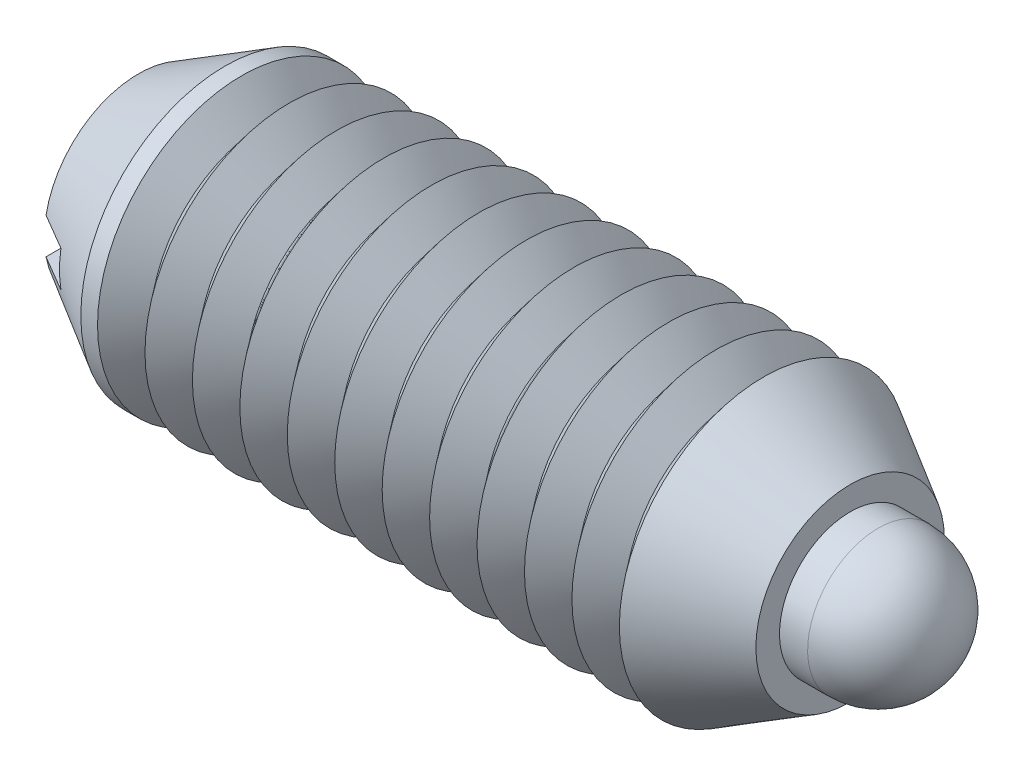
ISO-10303-21;
HEADER;
FILE_DESCRIPTION(('STEP AP214'),'2;1');
FILE_NAME('part.step','',(''),(''),'','','');
FILE_SCHEMA(('AUTOMOTIVE_DESIGN { 1 0 10303 214 1 1 1 1 }'));
ENDSEC;
DATA;
#1=APPLICATION_CONTEXT('core data for automotive mechanical design processes');
#2=APPLICATION_PROTOCOL_DEFINITION('international standard','automotive_design',2000,#1);
#3=PRODUCT_CONTEXT('',#1,'mechanical');
#4=PRODUCT('Part','Part','',(#3));
#5=PRODUCT_RELATED_PRODUCT_CATEGORY('part','',(#4));
#6=PRODUCT_DEFINITION_FORMATION('','',#4);
#7=PRODUCT_DEFINITION_CONTEXT('part definition',#1,'design');
#8=PRODUCT_DEFINITION('design','',#6,#7);
#9=PRODUCT_DEFINITION_SHAPE('','',#8);
#10=(LENGTH_UNIT() NAMED_UNIT(*) SI_UNIT(.MILLI.,.METRE.));
#11=(NAMED_UNIT(*) PLANE_ANGLE_UNIT() SI_UNIT($,.RADIAN.));
#12=(NAMED_UNIT(*) SI_UNIT($,.STERADIAN.) SOLID_ANGLE_UNIT());
#13=UNCERTAINTY_MEASURE_WITH_UNIT(LENGTH_MEASURE(1.E-05),#10,'distance_accuracy_value','');
#14=(GEOMETRIC_REPRESENTATION_CONTEXT(3) GLOBAL_UNCERTAINTY_ASSIGNED_CONTEXT((#13)) GLOBAL_UNIT_ASSIGNED_CONTEXT((#10,
#11,#12)) REPRESENTATION_CONTEXT('',''));
#15=CARTESIAN_POINT('',(0.,0.,0.));
#16=DIRECTION('',(0.,0.,1.));
#17=DIRECTION('',(1.,0.,0.));
#18=AXIS2_PLACEMENT_3D('',#15,#16,#17);
#19=CARTESIAN_POINT('',(9.18972,0.,0.));
#20=DIRECTION('',(-1.,0.,0.));
#21=DIRECTION('',(0.,-0.719424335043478,-0.694570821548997));
#22=AXIS2_PLACEMENT_3D('',#19,#20,#21);
#23=PLANE('',#22);
#24=CARTESIAN_POINT('',(9.18972,0.,0.));
#25=DIRECTION('',(1.,0.,0.));
#26=DIRECTION('',(0.,0.719424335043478,0.694570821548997));
#27=AXIS2_PLACEMENT_3D('',#24,#25,#26);
#28=CIRCLE('',#27,1.1811);
#29=CARTESIAN_POINT('',(9.18972,0.849712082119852,0.82035759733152));
#30=VERTEX_POINT('',#29);
#31=EDGE_CURVE('P0_E10',#30,#30,#28,.T.);
#32=ORIENTED_EDGE('',*,*,#31,.F.);
#33=EDGE_LOOP('',(#32));
#34=FACE_BOUND('',#33,.T.);
#35=ADVANCED_FACE('P0_F14',(#34),#23,.T.);
#36=CARTESIAN_POINT('',(9.42594,0.,0.));
#37=DIRECTION('',(1.,0.,0.));
#38=DIRECTION('',(0.,0.719424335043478,0.694570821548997));
#39=AXIS2_PLACEMENT_3D('',#36,#37,#38);
#40=CONICAL_SURFACE('',#39,1.41732,0.785398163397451);
#41=ORIENTED_EDGE('',*,*,#31,.T.);
#42=EDGE_LOOP('',(#41));
#43=FACE_BOUND('',#42,.T.);
#44=CARTESIAN_POINT('',(9.42594,0.,0.));
#45=DIRECTION('',(1.,0.,0.));
#46=DIRECTION('',(0.,0.719424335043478,0.694570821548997));
#47=AXIS2_PLACEMENT_3D('',#44,#45,#46);
#48=CIRCLE('',#47,1.41732);
#49=CARTESIAN_POINT('',(9.42594,1.01965449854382,0.984429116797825));
#50=VERTEX_POINT('',#49);
#51=EDGE_CURVE('P0_E20',#50,#50,#48,.T.);
#52=ORIENTED_EDGE('',*,*,#51,.F.);
#53=EDGE_LOOP('',(#52));
#54=FACE_BOUND('',#53,.T.);
#55=ADVANCED_FACE('P0_F54',(#43,#54),#40,.T.);
#56=CARTESIAN_POINT('',(13.55725,0.,0.));
#57=DIRECTION('',(1.,0.,0.));
#58=DIRECTION('',(0.,0.719424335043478,0.694570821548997));
#59=AXIS2_PLACEMENT_3D('',#56,#57,#58);
#60=CYLINDRICAL_SURFACE('',#59,1.41732);
#61=ORIENTED_EDGE('',*,*,#51,.T.);
#62=EDGE_LOOP('',(#61));
#63=FACE_BOUND('',#62,.T.);
#64=CARTESIAN_POINT('',(11.1427749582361,0.,0.));
#65=DIRECTION('',(1.,0.,0.));
#66=DIRECTION('',(0.,0.719424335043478,0.694570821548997));
#67=AXIS2_PLACEMENT_3D('',#64,#65,#66);
#68=CIRCLE('',#67,1.41732);
#69=CARTESIAN_POINT('',(11.1427749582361,1.01965449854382,0.984429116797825));
#70=VERTEX_POINT('',#69);
#71=EDGE_CURVE('P0_E24',#70,#70,#68,.T.);
#72=ORIENTED_EDGE('',*,*,#71,.F.);
#73=EDGE_LOOP('',(#72));
#74=FACE_BOUND('',#73,.T.);
#75=ADVANCED_FACE('P0_F50',(#63,#74),#60,.T.);
#76=CARTESIAN_POINT('',(11.55192,0.,0.));
#77=DIRECTION('',(-1.,0.,0.));
#78=DIRECTION('',(0.,-0.719424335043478,-0.694570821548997));
#79=AXIS2_PLACEMENT_3D('',#76,#77,#78);
#80=CONICAL_SURFACE('',#79,1.1811,0.523598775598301);
#81=ORIENTED_EDGE('',*,*,#71,.T.);
#82=EDGE_LOOP('',(#81));
#83=FACE_BOUND('',#82,.T.);
#84=CARTESIAN_POINT('',(11.55192,0.,0.));
#85=DIRECTION('',(1.,0.,0.));
#86=DIRECTION('',(0.,0.719424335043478,0.694570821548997));
#87=AXIS2_PLACEMENT_3D('',#84,#85,#86);
#88=CIRCLE('',#87,1.1811);
#89=CARTESIAN_POINT('',(11.55192,0.849712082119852,0.820357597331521));
#90=VERTEX_POINT('',#89);
#91=EDGE_CURVE('P0_E28',#90,#90,#88,.T.);
#92=ORIENTED_EDGE('',*,*,#91,.F.);
#93=EDGE_LOOP('',(#92));
#94=FACE_BOUND('',#93,.T.);
#95=ADVANCED_FACE('P0_F41',(#83,#94),#80,.T.);
#96=CARTESIAN_POINT('',(13.55725,0.,0.));
#97=DIRECTION('',(1.,0.,0.));
#98=DIRECTION('',(0.,0.719424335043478,0.694570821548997));
#99=AXIS2_PLACEMENT_3D('',#96,#97,#98);
#100=CYLINDRICAL_SURFACE('',#99,1.1811);
#101=ORIENTED_EDGE('',*,*,#91,.T.);
#102=EDGE_LOOP('',(#101));
#103=FACE_BOUND('',#102,.T.);
#104=CARTESIAN_POINT('',(12.37615,0.,0.));
#105=DIRECTION('',(1.,0.,0.));
#106=DIRECTION('',(0.,0.719424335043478,0.694570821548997));
#107=AXIS2_PLACEMENT_3D('',#104,#105,#106);
#108=CIRCLE('',#107,1.1811);
#109=CARTESIAN_POINT('',(12.37615,0.849712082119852,0.820357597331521));
#110=VERTEX_POINT('',#109);
#111=EDGE_CURVE('P0_E33',#110,#110,#108,.T.);
#112=ORIENTED_EDGE('',*,*,#111,.F.);
#113=EDGE_LOOP('',(#112));
#114=FACE_BOUND('',#113,.T.);
#115=ADVANCED_FACE('P0_F39',(#103,#114),#100,.T.);
#116=CARTESIAN_POINT('',(12.37615,0.,0.));
#117=DIRECTION('',(1.,0.,0.));
#118=DIRECTION('',(0.,-0.719424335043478,-0.694570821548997));
#119=AXIS2_PLACEMENT_3D('',#116,#117,#118);
#120=SPHERICAL_SURFACE('',#119,1.1811);
#121=ORIENTED_EDGE('',*,*,#111,.T.);
#122=EDGE_LOOP('',(#121));
#123=FACE_BOUND('',#122,.T.);
#124=ADVANCED_FACE('P0_F37',(#123),#120,.T.);
#125=CLOSED_SHELL('',(#35,#55,#75,#95,#115,#124));
#126=MANIFOLD_SOLID_BREP('P0_B1',#125);
#127=CARTESIAN_POINT('',(3.96875,4.826,-2.413));
#128=DIRECTION('',(-1.,0.,0.));
#129=DIRECTION('',(0.,-1.,0.));
#130=AXIS2_PLACEMENT_3D('',#127,#128,#129);
#131=PLANE('',#130);
#132=CARTESIAN_POINT('',(3.96875,0.,0.));
#133=DIRECTION('',(-1.,0.,0.));
#134=DIRECTION('',(0.,-1.,0.));
#135=AXIS2_PLACEMENT_3D('',#132,#133,#134);
#136=CIRCLE('',#135,2.23851475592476);
#137=CARTESIAN_POINT('',(3.96875,-2.23851475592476,0.));
#138=VERTEX_POINT('',#137);
#139=EDGE_CURVE('P1_E31',#138,#138,#136,.F.);
#140=ORIENTED_EDGE('',*,*,#139,.F.);
#141=EDGE_LOOP('',(#140));
#142=FACE_BOUND('',#141,.T.);
#143=CARTESIAN_POINT('',(3.96875,0.,0.));
#144=DIRECTION('',(1.,0.,0.));
#145=DIRECTION('',(0.,0.,-1.));
#146=AXIS2_PLACEMENT_3D('',#143,#144,#145);
#147=CIRCLE('',#146,1.44272);
#148=CARTESIAN_POINT('',(3.96875,0.,-1.44272));
#149=VERTEX_POINT('',#148);
#150=EDGE_CURVE('P1_E47',#149,#149,#147,.T.);
#151=ORIENTED_EDGE('',*,*,#150,.T.);
#152=EDGE_LOOP('',(#151));
#153=FACE_BOUND('',#152,.T.);
#154=ADVANCED_FACE('P1_F14',(#142,#153),#131,.T.);
#155=CARTESIAN_POINT('',(7.9375,4.826,-2.413));
#156=DIRECTION('',(1.,0.,0.));
#157=DIRECTION('',(0.,0.,-1.));
#158=AXIS2_PLACEMENT_3D('',#155,#156,#157);
#159=PLANE('',#158);
#160=CARTESIAN_POINT('',(7.9375,0.,0.));
#161=DIRECTION('',(1.,0.,0.));
#162=DIRECTION('',(0.,0.,-1.));
#163=AXIS2_PLACEMENT_3D('',#160,#161,#162);
#164=CIRCLE('',#163,2.23851475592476);
#165=CARTESIAN_POINT('',(7.9375,0.,-2.23851475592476));
#166=VERTEX_POINT('',#165);
#167=EDGE_CURVE('P1_E33',#166,#166,#164,.F.);
#168=ORIENTED_EDGE('',*,*,#167,.F.);
#169=EDGE_LOOP('',(#168));
#170=FACE_BOUND('',#169,.T.);
#171=CARTESIAN_POINT('',(7.9375,0.,0.));
#172=DIRECTION('',(1.,0.,0.));
#173=DIRECTION('',(0.,0.,-1.));
#174=AXIS2_PLACEMENT_3D('',#171,#172,#173);
#175=CIRCLE('',#174,1.44272);
#176=CARTESIAN_POINT('',(7.9375,0.,-1.44272));
#177=VERTEX_POINT('',#176);
#178=EDGE_CURVE('P1_E18',#177,#177,#175,.F.);
#179=ORIENTED_EDGE('',*,*,#178,.T.);
#180=EDGE_LOOP('',(#179));
#181=FACE_BOUND('',#180,.T.);
#182=ADVANCED_FACE('P1_F80',(#170,#181),#159,.T.);
#183=CARTESIAN_POINT('',(6.09282499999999,0.,0.));
#184=DIRECTION('',(1.,0.,0.));
#185=DIRECTION('',(0.,0.,-1.));
#186=AXIS2_PLACEMENT_3D('',#183,#184,#185);
#187=CONICAL_SURFACE('',#186,1.91730328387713,0.895664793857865);
#188=CARTESIAN_POINT('',(6.48969999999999,0.,0.));
#189=DIRECTION('',(-1.,0.,0.));
#190=DIRECTION('',(0.,0.,1.));
#191=AXIS2_PLACEMENT_3D('',#188,#189,#190);
#192=CIRCLE('',#191,2.413);
#193=CARTESIAN_POINT('',(6.48969999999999,0.,2.413));
#194=VERTEX_POINT('',#193);
#195=EDGE_CURVE('P1_E57',#194,#194,#192,.T.);
#196=ORIENTED_EDGE('',*,*,#195,.T.);
#197=EDGE_LOOP('',(#196));
#198=FACE_BOUND('',#197,.T.);
#199=CARTESIAN_POINT('',(6.09282499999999,0.,0.));
#200=DIRECTION('',(-1.,0.,0.));
#201=DIRECTION('',(0.,0.,1.));
#202=AXIS2_PLACEMENT_3D('',#199,#200,#201);
#203=CIRCLE('',#202,1.91730328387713);
#204=CARTESIAN_POINT('',(6.09282499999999,0.,1.91730328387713));
#205=VERTEX_POINT('',#204);
#206=EDGE_CURVE('P1_E60',#205,#205,#203,.T.);
#207=ORIENTED_EDGE('',*,*,#206,.F.);
#208=EDGE_LOOP('',(#207));
#209=FACE_BOUND('',#208,.T.);
#210=ADVANCED_FACE('P1_F86',(#198,#209),#187,.T.);
#211=CARTESIAN_POINT('',(6.48969999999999,0.,0.));
#212=DIRECTION('',(-1.,0.,0.));
#213=DIRECTION('',(0.,0.,1.));
#214=AXIS2_PLACEMENT_3D('',#211,#212,#213);
#215=CONICAL_SURFACE('',#214,2.413,0.895664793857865);
#216=CARTESIAN_POINT('',(6.88657499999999,0.,0.));
#217=DIRECTION('',(-1.,0.,0.));
#218=DIRECTION('',(0.,0.,1.));
#219=AXIS2_PLACEMENT_3D('',#216,#217,#218);
#220=CIRCLE('',#219,1.91730328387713);
#221=CARTESIAN_POINT('',(6.88657499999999,0.,1.91730328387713));
#222=VERTEX_POINT('',#221);
#223=EDGE_CURVE('P1_E22',#222,#222,#220,.T.);
#224=ORIENTED_EDGE('',*,*,#223,.T.);
#225=EDGE_LOOP('',(#224));
#226=FACE_BOUND('',#225,.T.);
#227=ORIENTED_EDGE('',*,*,#195,.F.);
#228=EDGE_LOOP('',(#227));
#229=FACE_BOUND('',#228,.T.);
#230=ADVANCED_FACE('P1_F77',(#226,#229),#215,.T.);
#231=CARTESIAN_POINT('',(6.88657499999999,0.,0.));
#232=DIRECTION('',(1.,0.,0.));
#233=DIRECTION('',(0.,0.,-1.));
#234=AXIS2_PLACEMENT_3D('',#231,#232,#233);
#235=CONICAL_SURFACE('',#234,1.91730328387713,0.895664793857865);
#236=CARTESIAN_POINT('',(7.28344999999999,0.,0.));
#237=DIRECTION('',(-1.,0.,0.));
#238=DIRECTION('',(0.,0.,1.));
#239=AXIS2_PLACEMENT_3D('',#236,#237,#238);
#240=CIRCLE('',#239,2.413);
#241=CARTESIAN_POINT('',(7.28344999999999,0.,2.413));
#242=VERTEX_POINT('',#241);
#243=EDGE_CURVE('P1_E27',#242,#242,#240,.T.);
#244=ORIENTED_EDGE('',*,*,#243,.T.);
#245=EDGE_LOOP('',(#244));
#246=FACE_BOUND('',#245,.T.);
#247=ORIENTED_EDGE('',*,*,#223,.F.);
#248=EDGE_LOOP('',(#247));
#249=FACE_BOUND('',#248,.T.);
#250=ADVANCED_FACE('P1_F65',(#246,#249),#235,.T.);
#251=CARTESIAN_POINT('',(7.28344999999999,0.,0.));
#252=DIRECTION('',(-1.,0.,0.));
#253=DIRECTION('',(0.,0.,1.));
#254=AXIS2_PLACEMENT_3D('',#251,#252,#253);
#255=CONICAL_SURFACE('',#254,2.413,0.895664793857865);
#256=CARTESIAN_POINT('',(7.68032499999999,0.,0.));
#257=DIRECTION('',(-1.,0.,0.));
#258=DIRECTION('',(0.,0.,1.));
#259=AXIS2_PLACEMENT_3D('',#256,#257,#258);
#260=CIRCLE('',#259,1.91730328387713);
#261=CARTESIAN_POINT('',(7.68032499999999,0.,1.91730328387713));
#262=VERTEX_POINT('',#261);
#263=EDGE_CURVE('P1_E10',#262,#262,#260,.T.);
#264=ORIENTED_EDGE('',*,*,#263,.T.);
#265=EDGE_LOOP('',(#264));
#266=FACE_BOUND('',#265,.T.);
#267=ORIENTED_EDGE('',*,*,#243,.F.);
#268=EDGE_LOOP('',(#267));
#269=FACE_BOUND('',#268,.T.);
#270=ADVANCED_FACE('P1_F68',(#266,#269),#255,.T.);
#271=CARTESIAN_POINT('',(7.68032499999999,0.,0.));
#272=DIRECTION('',(1.,0.,0.));
#273=DIRECTION('',(0.,0.,-1.));
#274=AXIS2_PLACEMENT_3D('',#271,#272,#273);
#275=CONICAL_SURFACE('',#274,1.91730328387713,0.895664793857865);
#276=ORIENTED_EDGE('',*,*,#263,.F.);
#277=EDGE_LOOP('',(#276));
#278=FACE_BOUND('',#277,.T.);
#279=ORIENTED_EDGE('',*,*,#167,.T.);
#280=EDGE_LOOP('',(#279));
#281=FACE_BOUND('',#280,.T.);
#282=ADVANCED_FACE('P1_F16',(#278,#281),#275,.T.);
#283=CARTESIAN_POINT('',(5.69594999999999,0.,0.));
#284=DIRECTION('',(-1.,0.,0.));
#285=DIRECTION('',(0.,0.,1.));
#286=AXIS2_PLACEMENT_3D('',#283,#284,#285);
#287=CONICAL_SURFACE('',#286,2.413,0.895664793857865);
#288=ORIENTED_EDGE('',*,*,#206,.T.);
#289=EDGE_LOOP('',(#288));
#290=FACE_BOUND('',#289,.T.);
#291=CARTESIAN_POINT('',(5.69594999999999,0.,0.));
#292=DIRECTION('',(-1.,0.,0.));
#293=DIRECTION('',(0.,0.,1.));
#294=AXIS2_PLACEMENT_3D('',#291,#292,#293);
#295=CIRCLE('',#294,2.413);
#296=CARTESIAN_POINT('',(5.69594999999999,0.,2.413));
#297=VERTEX_POINT('',#296);
#298=EDGE_CURVE('P1_E51',#297,#297,#295,.T.);
#299=ORIENTED_EDGE('',*,*,#298,.F.);
#300=EDGE_LOOP('',(#299));
#301=FACE_BOUND('',#300,.T.);
#302=ADVANCED_FACE('P1_F75',(#290,#301),#287,.T.);
#303=CARTESIAN_POINT('',(5.29907499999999,0.,0.));
#304=DIRECTION('',(1.,0.,0.));
#305=DIRECTION('',(0.,0.,-1.));
#306=AXIS2_PLACEMENT_3D('',#303,#304,#305);
#307=CONICAL_SURFACE('',#306,1.91730328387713,0.895664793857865);
#308=ORIENTED_EDGE('',*,*,#298,.T.);
#309=EDGE_LOOP('',(#308));
#310=FACE_BOUND('',#309,.T.);
#311=CARTESIAN_POINT('',(5.29907499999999,0.,0.));
#312=DIRECTION('',(-1.,0.,0.));
#313=DIRECTION('',(0.,0.,1.));
#314=AXIS2_PLACEMENT_3D('',#311,#312,#313);
#315=CIRCLE('',#314,1.91730328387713);
#316=CARTESIAN_POINT('',(5.29907499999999,0.,1.91730328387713));
#317=VERTEX_POINT('',#316);
#318=EDGE_CURVE('P1_E54',#317,#317,#315,.T.);
#319=ORIENTED_EDGE('',*,*,#318,.F.);
#320=EDGE_LOOP('',(#319));
#321=FACE_BOUND('',#320,.T.);
#322=ADVANCED_FACE('P1_F108',(#310,#321),#307,.T.);
#323=CARTESIAN_POINT('',(4.90219999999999,0.,0.));
#324=DIRECTION('',(-1.,0.,0.));
#325=DIRECTION('',(0.,0.,1.));
#326=AXIS2_PLACEMENT_3D('',#323,#324,#325);
#327=CONICAL_SURFACE('',#326,2.413,0.895664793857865);
#328=ORIENTED_EDGE('',*,*,#318,.T.);
#329=EDGE_LOOP('',(#328));
#330=FACE_BOUND('',#329,.T.);
#331=CARTESIAN_POINT('',(4.90219999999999,0.,0.));
#332=DIRECTION('',(-1.,0.,0.));
#333=DIRECTION('',(0.,0.,1.));
#334=AXIS2_PLACEMENT_3D('',#331,#332,#333);
#335=CIRCLE('',#334,2.413);
#336=CARTESIAN_POINT('',(4.90219999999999,0.,2.413));
#337=VERTEX_POINT('',#336);
#338=EDGE_CURVE('P1_E39',#337,#337,#335,.T.);
#339=ORIENTED_EDGE('',*,*,#338,.F.);
#340=EDGE_LOOP('',(#339));
#341=FACE_BOUND('',#340,.T.);
#342=ADVANCED_FACE('P1_F104',(#330,#341),#327,.T.);
#343=CARTESIAN_POINT('',(4.50532499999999,0.,0.));
#344=DIRECTION('',(1.,0.,0.));
#345=DIRECTION('',(0.,0.,-1.));
#346=AXIS2_PLACEMENT_3D('',#343,#344,#345);
#347=CONICAL_SURFACE('',#346,1.91730328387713,0.895664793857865);
#348=ORIENTED_EDGE('',*,*,#338,.T.);
#349=EDGE_LOOP('',(#348));
#350=FACE_BOUND('',#349,.T.);
#351=CARTESIAN_POINT('',(4.50532499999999,0.,0.));
#352=DIRECTION('',(-1.,0.,0.));
#353=DIRECTION('',(0.,0.,1.));
#354=AXIS2_PLACEMENT_3D('',#351,#352,#353);
#355=CIRCLE('',#354,1.91730328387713);
#356=CARTESIAN_POINT('',(4.50532499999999,0.,1.91730328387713));
#357=VERTEX_POINT('',#356);
#358=EDGE_CURVE('P1_E44',#357,#357,#355,.T.);
#359=ORIENTED_EDGE('',*,*,#358,.F.);
#360=EDGE_LOOP('',(#359));
#361=FACE_BOUND('',#360,.T.);
#362=ADVANCED_FACE('P1_F100',(#350,#361),#347,.T.);
#363=CARTESIAN_POINT('',(4.10844999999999,0.,0.));
#364=DIRECTION('',(-1.,0.,0.));
#365=DIRECTION('',(0.,0.,1.));
#366=AXIS2_PLACEMENT_3D('',#363,#364,#365);
#367=CONICAL_SURFACE('',#366,2.413,0.895664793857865);
#368=ORIENTED_EDGE('',*,*,#358,.T.);
#369=EDGE_LOOP('',(#368));
#370=FACE_BOUND('',#369,.T.);
#371=CARTESIAN_POINT('',(4.10844999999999,0.,0.));
#372=DIRECTION('',(-1.,0.,0.));
#373=DIRECTION('',(0.,0.,1.));
#374=AXIS2_PLACEMENT_3D('',#371,#372,#373);
#375=CIRCLE('',#374,2.413);
#376=CARTESIAN_POINT('',(4.10844999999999,0.,2.413));
#377=VERTEX_POINT('',#376);
#378=EDGE_CURVE('P1_E35',#377,#377,#375,.T.);
#379=ORIENTED_EDGE('',*,*,#378,.F.);
#380=EDGE_LOOP('',(#379));
#381=FACE_BOUND('',#380,.T.);
#382=ADVANCED_FACE('P1_F97',(#370,#381),#367,.T.);
#383=CARTESIAN_POINT('',(3.71157499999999,0.,0.));
#384=DIRECTION('',(1.,0.,0.));
#385=DIRECTION('',(0.,0.,-1.));
#386=AXIS2_PLACEMENT_3D('',#383,#384,#385);
#387=CONICAL_SURFACE('',#386,1.91730328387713,0.895664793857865);
#388=ORIENTED_EDGE('',*,*,#378,.T.);
#389=EDGE_LOOP('',(#388));
#390=FACE_BOUND('',#389,.T.);
#391=ORIENTED_EDGE('',*,*,#139,.T.);
#392=EDGE_LOOP('',(#391));
#393=FACE_BOUND('',#392,.T.);
#394=ADVANCED_FACE('P1_F93',(#390,#393),#387,.T.);
#395=CARTESIAN_POINT('',(11.90625,0.,0.));
#396=DIRECTION('',(-1.,0.,0.));
#397=DIRECTION('',(0.,0.,1.));
#398=AXIS2_PLACEMENT_3D('',#395,#396,#397);
#399=CYLINDRICAL_SURFACE('',#398,1.44272);
#400=ORIENTED_EDGE('',*,*,#178,.F.);
#401=EDGE_LOOP('',(#400));
#402=FACE_BOUND('',#401,.T.);
#403=ORIENTED_EDGE('',*,*,#150,.F.);
#404=EDGE_LOOP('',(#403));
#405=FACE_BOUND('',#404,.T.);
#406=ADVANCED_FACE('P1_F96',(#402,#405),#399,.F.);
#407=CLOSED_SHELL('',(#154,#182,#210,#230,#250,#270,#282,#302,#322,#342,#362,#382,#394,#406));
#408=MANIFOLD_SOLID_BREP('P1_B1',#407);
#409=CARTESIAN_POINT('',(11.90625,0.,0.));
#410=DIRECTION('',(1.,0.,0.));
#411=DIRECTION('',(0.,0.,-1.));
#412=AXIS2_PLACEMENT_3D('',#409,#410,#411);
#413=PLANE('',#412);
#414=CARTESIAN_POINT('',(11.90625,0.,0.));
#415=DIRECTION('',(1.,0.,0.));
#416=DIRECTION('',(0.,0.,-1.));
#417=AXIS2_PLACEMENT_3D('',#414,#415,#416);
#418=CIRCLE('',#417,1.57711228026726);
#419=CARTESIAN_POINT('',(11.90625,0.,-1.57711228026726));
#420=VERTEX_POINT('',#419);
#421=EDGE_CURVE('P2_E79',#420,#420,#418,.T.);
#422=ORIENTED_EDGE('',*,*,#421,.T.);
#423=EDGE_LOOP('',(#422));
#424=FACE_BOUND('',#423,.T.);
#425=CARTESIAN_POINT('',(11.90625,0.,0.));
#426=DIRECTION('',(-1.,0.,0.));
#427=DIRECTION('',(0.,0.,1.));
#428=AXIS2_PLACEMENT_3D('',#425,#426,#427);
#429=CIRCLE('',#428,1.1811);
#430=CARTESIAN_POINT('',(11.90625,0.,1.1811));
#431=VERTEX_POINT('',#430);
#432=EDGE_CURVE('P2_E66',#431,#431,#429,.T.);
#433=ORIENTED_EDGE('',*,*,#432,.T.);
#434=EDGE_LOOP('',(#433));
#435=FACE_BOUND('',#434,.T.);
#436=ADVANCED_FACE('P2_F15',(#424,#435),#413,.T.);
#437=CARTESIAN_POINT('',(11.90625,0.,0.));
#438=DIRECTION('',(-1.,0.,0.));
#439=DIRECTION('',(0.,0.,1.));
#440=AXIS2_PLACEMENT_3D('',#437,#438,#439);
#441=CONICAL_SURFACE('',#440,1.57711228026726,0.523598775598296);
#442=CARTESIAN_POINT('',(10.45845,0.,0.));
#443=DIRECTION('',(-1.,0.,0.));
#444=DIRECTION('',(0.,0.,1.));
#445=AXIS2_PLACEMENT_3D('',#442,#443,#444);
#446=CIRCLE('',#445,2.413);
#447=CARTESIAN_POINT('',(10.45845,0.,2.413));
#448=VERTEX_POINT('',#447);
#449=EDGE_CURVE('P2_E157',#448,#448,#446,.T.);
#450=ORIENTED_EDGE('',*,*,#449,.F.);
#451=EDGE_LOOP('',(#450));
#452=FACE_BOUND('',#451,.T.);
#453=ORIENTED_EDGE('',*,*,#421,.F.);
#454=EDGE_LOOP('',(#453));
#455=FACE_BOUND('',#454,.T.);
#456=ADVANCED_FACE('P2_F17',(#452,#455),#441,.T.);
#457=CARTESIAN_POINT('',(0.,0.,0.));
#458=DIRECTION('',(-1.,0.,0.));
#459=DIRECTION('',(0.,0.,1.));
#460=AXIS2_PLACEMENT_3D('',#457,#458,#459);
#461=CYLINDRICAL_SURFACE('',#460,1.1811);
#462=CARTESIAN_POINT('',(11.55192,0.,0.));
#463=DIRECTION('',(-1.,0.,0.));
#464=DIRECTION('',(0.,0.,1.));
#465=AXIS2_PLACEMENT_3D('',#462,#463,#464);
#466=CIRCLE('',#465,1.1811);
#467=CARTESIAN_POINT('',(11.55192,0.,1.1811));
#468=VERTEX_POINT('',#467);
#469=EDGE_CURVE('P2_E169',#468,#468,#466,.T.);
#470=ORIENTED_EDGE('',*,*,#469,.T.);
#471=EDGE_LOOP('',(#470));
#472=FACE_BOUND('',#471,.T.);
#473=ORIENTED_EDGE('',*,*,#432,.F.);
#474=EDGE_LOOP('',(#473));
#475=FACE_BOUND('',#474,.T.);
#476=ADVANCED_FACE('P2_F195',(#472,#475),#461,.F.);
#477=CARTESIAN_POINT('',(11.55192,0.,0.));
#478=DIRECTION('',(-1.,0.,0.));
#479=DIRECTION('',(0.,0.,1.));
#480=AXIS2_PLACEMENT_3D('',#477,#478,#479);
#481=CONICAL_SURFACE('',#480,1.1811,0.785398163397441);
#482=CARTESIAN_POINT('',(11.3157,0.,0.));
#483=DIRECTION('',(-1.,0.,0.));
#484=DIRECTION('',(0.,0.,1.));
#485=AXIS2_PLACEMENT_3D('',#482,#483,#484);
#486=CIRCLE('',#485,1.41732);
#487=CARTESIAN_POINT('',(11.3157,0.,1.41732));
#488=VERTEX_POINT('',#487);
#489=EDGE_CURVE('P2_E166',#488,#488,#486,.T.);
#490=ORIENTED_EDGE('',*,*,#489,.T.);
#491=EDGE_LOOP('',(#490));
#492=FACE_BOUND('',#491,.T.);
#493=ORIENTED_EDGE('',*,*,#469,.F.);
#494=EDGE_LOOP('',(#493));
#495=FACE_BOUND('',#494,.T.);
#496=ADVANCED_FACE('P2_F202',(#492,#495),#481,.F.);
#497=CARTESIAN_POINT('',(0.,0.,0.));
#498=DIRECTION('',(-1.,0.,0.));
#499=DIRECTION('',(0.,0.,1.));
#500=AXIS2_PLACEMENT_3D('',#497,#498,#499);
#501=CYLINDRICAL_SURFACE('',#500,1.41732);
#502=CARTESIAN_POINT('',(1.80975,0.,0.));
#503=DIRECTION('',(-1.,0.,0.));
#504=DIRECTION('',(0.,0.,1.));
#505=AXIS2_PLACEMENT_3D('',#502,#503,#504);
#506=CIRCLE('',#505,1.41732);
#507=CARTESIAN_POINT('',(1.80975,0.,1.41732));
#508=VERTEX_POINT('',#507);
#509=EDGE_CURVE('P2_E163',#508,#508,#506,.T.);
#510=ORIENTED_EDGE('',*,*,#509,.T.);
#511=EDGE_LOOP('',(#510));
#512=FACE_BOUND('',#511,.T.);
#513=ORIENTED_EDGE('',*,*,#489,.F.);
#514=EDGE_LOOP('',(#513));
#515=FACE_BOUND('',#514,.T.);
#516=ADVANCED_FACE('P2_F207',(#512,#515),#501,.F.);
#517=CARTESIAN_POINT('',(1.80975,0.,0.));
#518=DIRECTION('',(1.,0.,0.));
#519=DIRECTION('',(0.,0.,-1.));
#520=AXIS2_PLACEMENT_3D('',#517,#518,#519);
#521=PLANE('',#520);
#522=ORIENTED_EDGE('',*,*,#509,.F.);
#523=EDGE_LOOP('',(#522));
#524=FACE_BOUND('',#523,.T.);
#525=ADVANCED_FACE('P2_F213',(#524),#521,.T.);
#526=CARTESIAN_POINT('',(10.061575,0.,0.));
#527=DIRECTION('',(1.,0.,0.));
#528=DIRECTION('',(0.,0.,-1.));
#529=AXIS2_PLACEMENT_3D('',#526,#527,#528);
#530=CONICAL_SURFACE('',#529,1.91730328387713,0.895664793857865);
#531=ORIENTED_EDGE('',*,*,#449,.T.);
#532=EDGE_LOOP('',(#531));
#533=FACE_BOUND('',#532,.T.);
#534=CARTESIAN_POINT('',(10.061575,0.,0.));
#535=DIRECTION('',(-1.,0.,0.));
#536=DIRECTION('',(0.,0.,1.));
#537=AXIS2_PLACEMENT_3D('',#534,#535,#536);
#538=CIRCLE('',#537,1.91730328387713);
#539=CARTESIAN_POINT('',(10.061575,0.,1.91730328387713));
#540=VERTEX_POINT('',#539);
#541=EDGE_CURVE('P2_E160',#540,#540,#538,.T.);
#542=ORIENTED_EDGE('',*,*,#541,.F.);
#543=EDGE_LOOP('',(#542));
#544=FACE_BOUND('',#543,.T.);
#545=ADVANCED_FACE('P2_F217',(#533,#544),#530,.T.);
#546=CARTESIAN_POINT('',(9.66469999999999,0.,0.));
#547=DIRECTION('',(-1.,0.,0.));
#548=DIRECTION('',(0.,0.,1.));
#549=AXIS2_PLACEMENT_3D('',#546,#547,#548);
#550=CONICAL_SURFACE('',#549,2.413,0.895664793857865);
#551=ORIENTED_EDGE('',*,*,#541,.T.);
#552=EDGE_LOOP('',(#551));
#553=FACE_BOUND('',#552,.T.);
#554=CARTESIAN_POINT('',(9.66469999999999,0.,0.));
#555=DIRECTION('',(-1.,0.,0.));
#556=DIRECTION('',(0.,0.,1.));
#557=AXIS2_PLACEMENT_3D('',#554,#555,#556);
#558=CIRCLE('',#557,2.413);
#559=CARTESIAN_POINT('',(9.66469999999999,0.,2.413));
#560=VERTEX_POINT('',#559);
#561=EDGE_CURVE('P2_E151',#560,#560,#558,.T.);
#562=ORIENTED_EDGE('',*,*,#561,.F.);
#563=EDGE_LOOP('',(#562));
#564=FACE_BOUND('',#563,.T.);
#565=ADVANCED_FACE('P2_F221',(#553,#564),#550,.T.);
#566=CARTESIAN_POINT('',(9.26782499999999,0.,0.));
#567=DIRECTION('',(1.,0.,0.));
#568=DIRECTION('',(0.,0.,-1.));
#569=AXIS2_PLACEMENT_3D('',#566,#567,#568);
#570=CONICAL_SURFACE('',#569,1.91730328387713,0.895664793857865);
#571=ORIENTED_EDGE('',*,*,#561,.T.);
#572=EDGE_LOOP('',(#571));
#573=FACE_BOUND('',#572,.T.);
#574=CARTESIAN_POINT('',(9.26782499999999,0.,0.));
#575=DIRECTION('',(-1.,0.,0.));
#576=DIRECTION('',(0.,0.,1.));
#577=AXIS2_PLACEMENT_3D('',#574,#575,#576);
#578=CIRCLE('',#577,1.91730328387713);
#579=CARTESIAN_POINT('',(9.26782499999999,0.,1.91730328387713));
#580=VERTEX_POINT('',#579);
#581=EDGE_CURVE('P2_E154',#580,#580,#578,.T.);
#582=ORIENTED_EDGE('',*,*,#581,.F.);
#583=EDGE_LOOP('',(#582));
#584=FACE_BOUND('',#583,.T.);
#585=ADVANCED_FACE('P2_F225',(#573,#584),#570,.T.);
#586=CARTESIAN_POINT('',(8.87094999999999,0.,0.));
#587=DIRECTION('',(-1.,0.,0.));
#588=DIRECTION('',(0.,0.,1.));
#589=AXIS2_PLACEMENT_3D('',#586,#587,#588);
#590=CONICAL_SURFACE('',#589,2.413,0.895664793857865);
#591=ORIENTED_EDGE('',*,*,#581,.T.);
#592=EDGE_LOOP('',(#591));
#593=FACE_BOUND('',#592,.T.);
#594=CARTESIAN_POINT('',(8.87094999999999,0.,0.));
#595=DIRECTION('',(-1.,0.,0.));
#596=DIRECTION('',(0.,0.,1.));
#597=AXIS2_PLACEMENT_3D('',#594,#595,#596);
#598=CIRCLE('',#597,2.413);
#599=CARTESIAN_POINT('',(8.87094999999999,0.,2.413));
#600=VERTEX_POINT('',#599);
#601=EDGE_CURVE('P2_E145',#600,#600,#598,.T.);
#602=ORIENTED_EDGE('',*,*,#601,.F.);
#603=EDGE_LOOP('',(#602));
#604=FACE_BOUND('',#603,.T.);
#605=ADVANCED_FACE('P2_F229',(#593,#604),#590,.T.);
#606=CARTESIAN_POINT('',(8.47407499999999,0.,0.));
#607=DIRECTION('',(1.,0.,0.));
#608=DIRECTION('',(0.,0.,-1.));
#609=AXIS2_PLACEMENT_3D('',#606,#607,#608);
#610=CONICAL_SURFACE('',#609,1.91730328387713,0.895664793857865);
#611=ORIENTED_EDGE('',*,*,#601,.T.);
#612=EDGE_LOOP('',(#611));
#613=FACE_BOUND('',#612,.T.);
#614=CARTESIAN_POINT('',(8.47407499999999,0.,0.));
#615=DIRECTION('',(-1.,0.,0.));
#616=DIRECTION('',(0.,0.,1.));
#617=AXIS2_PLACEMENT_3D('',#614,#615,#616);
#618=CIRCLE('',#617,1.91730328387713);
#619=CARTESIAN_POINT('',(8.47407499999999,0.,1.91730328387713));
#620=VERTEX_POINT('',#619);
#621=EDGE_CURVE('P2_E148',#620,#620,#618,.T.);
#622=ORIENTED_EDGE('',*,*,#621,.F.);
#623=EDGE_LOOP('',(#622));
#624=FACE_BOUND('',#623,.T.);
#625=ADVANCED_FACE('P2_F233',(#613,#624),#610,.T.);
#626=CARTESIAN_POINT('',(8.07719999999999,0.,0.));
#627=DIRECTION('',(-1.,0.,0.));
#628=DIRECTION('',(0.,0.,1.));
#629=AXIS2_PLACEMENT_3D('',#626,#627,#628);
#630=CONICAL_SURFACE('',#629,2.413,0.895664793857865);
#631=ORIENTED_EDGE('',*,*,#621,.T.);
#632=EDGE_LOOP('',(#631));
#633=FACE_BOUND('',#632,.T.);
#634=CARTESIAN_POINT('',(8.07719999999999,0.,0.));
#635=DIRECTION('',(-1.,0.,0.));
#636=DIRECTION('',(0.,0.,1.));
#637=AXIS2_PLACEMENT_3D('',#634,#635,#636);
#638=CIRCLE('',#637,2.413);
#639=CARTESIAN_POINT('',(8.07719999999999,0.,2.413));
#640=VERTEX_POINT('',#639);
#641=EDGE_CURVE('P2_E142',#640,#640,#638,.T.);
#642=ORIENTED_EDGE('',*,*,#641,.F.);
#643=EDGE_LOOP('',(#642));
#644=FACE_BOUND('',#643,.T.);
#645=ADVANCED_FACE('P2_F237',(#633,#644),#630,.T.);
#646=CARTESIAN_POINT('',(7.68032499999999,0.,0.));
#647=DIRECTION('',(1.,0.,0.));
#648=DIRECTION('',(0.,0.,-1.));
#649=AXIS2_PLACEMENT_3D('',#646,#647,#648);
#650=CONICAL_SURFACE('',#649,1.91730328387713,0.895664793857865);
#651=CARTESIAN_POINT('',(7.9375,0.,0.));
#652=DIRECTION('',(1.,0.,0.));
#653=DIRECTION('',(0.,0.,-1.));
#654=AXIS2_PLACEMENT_3D('',#651,#652,#653);
#655=CIRCLE('',#654,2.23851475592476);
#656=CARTESIAN_POINT('',(7.9375,0.,-2.23851475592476));
#657=VERTEX_POINT('',#656);
#658=EDGE_CURVE('P2_E19',#657,#657,#655,.F.);
#659=ORIENTED_EDGE('',*,*,#658,.F.);
#660=EDGE_LOOP('',(#659));
#661=FACE_BOUND('',#660,.T.);
#662=ORIENTED_EDGE('',*,*,#641,.T.);
#663=EDGE_LOOP('',(#662));
#664=FACE_BOUND('',#663,.T.);
#665=ADVANCED_FACE('P2_F241',(#661,#664),#650,.T.);
#666=CARTESIAN_POINT('',(3.96875,0.,0.));
#667=DIRECTION('',(1.,0.,0.));
#668=DIRECTION('',(0.,0.,-1.));
#669=AXIS2_PLACEMENT_3D('',#666,#667,#668);
#670=PLANE('',#669);
#671=CARTESIAN_POINT('',(3.96875,0.,0.));
#672=DIRECTION('',(1.,0.,0.));
#673=DIRECTION('',(0.,0.,-1.));
#674=AXIS2_PLACEMENT_3D('',#671,#672,#673);
#675=CIRCLE('',#674,2.23851475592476);
#676=CARTESIAN_POINT('',(3.96875,0.,-2.23851475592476));
#677=VERTEX_POINT('',#676);
#678=EDGE_CURVE('P2_E110',#677,#677,#675,.F.);
#679=ORIENTED_EDGE('',*,*,#678,.F.);
#680=EDGE_LOOP('',(#679));
#681=FACE_BOUND('',#680,.T.);
#682=CARTESIAN_POINT('',(3.96875,0.,0.));
#683=DIRECTION('',(1.,0.,0.));
#684=DIRECTION('',(0.,0.,-1.));
#685=AXIS2_PLACEMENT_3D('',#682,#683,#684);
#686=CIRCLE('',#685,1.44272);
#687=CARTESIAN_POINT('',(3.96875,0.,-1.44272));
#688=VERTEX_POINT('',#687);
#689=EDGE_CURVE('P2_E112',#688,#688,#686,.T.);
#690=ORIENTED_EDGE('',*,*,#689,.F.);
#691=EDGE_LOOP('',(#690));
#692=FACE_BOUND('',#691,.T.);
#693=ADVANCED_FACE('P2_F245',(#681,#692),#670,.T.);
#694=CARTESIAN_POINT('',(14.9039160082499,0.,0.));
#695=DIRECTION('',(-1.,0.,0.));
#696=DIRECTION('',(0.,0.,1.));
#697=AXIS2_PLACEMENT_3D('',#694,#695,#696);
#698=CYLINDRICAL_SURFACE('',#697,1.44272);
#699=ORIENTED_EDGE('',*,*,#689,.T.);
#700=EDGE_LOOP('',(#699));
#701=FACE_BOUND('',#700,.T.);
#702=CARTESIAN_POINT('',(7.9375,0.,0.));
#703=DIRECTION('',(1.,0.,0.));
#704=DIRECTION('',(0.,0.,-1.));
#705=AXIS2_PLACEMENT_3D('',#702,#703,#704);
#706=CIRCLE('',#705,1.44272);
#707=CARTESIAN_POINT('',(7.9375,0.,-1.44272));
#708=VERTEX_POINT('',#707);
#709=EDGE_CURVE('P2_E118',#708,#708,#706,.T.);
#710=ORIENTED_EDGE('',*,*,#709,.F.);
#711=EDGE_LOOP('',(#710));
#712=FACE_BOUND('',#711,.T.);
#713=ADVANCED_FACE('P2_F186',(#701,#712),#698,.T.);
#714=CARTESIAN_POINT('',(7.9375,0.,0.));
#715=DIRECTION('',(1.,0.,0.));
#716=DIRECTION('',(0.,0.,-1.));
#717=AXIS2_PLACEMENT_3D('',#714,#715,#716);
#718=PLANE('',#717);
#719=ORIENTED_EDGE('',*,*,#658,.T.);
#720=EDGE_LOOP('',(#719));
#721=FACE_BOUND('',#720,.T.);
#722=ORIENTED_EDGE('',*,*,#709,.T.);
#723=EDGE_LOOP('',(#722));
#724=FACE_BOUND('',#723,.T.);
#725=ADVANCED_FACE('P2_F181',(#721,#724),#718,.F.);
#726=CARTESIAN_POINT('',(0.,0.,0.));
#727=DIRECTION('',(1.,0.,0.));
#728=DIRECTION('',(0.,0.,-1.));
#729=AXIS2_PLACEMENT_3D('',#726,#727,#728);
#730=PLANE('',#729);
#731=CARTESIAN_POINT('',(0.,0.,0.));
#732=DIRECTION('',(1.,0.,0.));
#733=DIRECTION('',(0.,0.,-1.));
#734=AXIS2_PLACEMENT_3D('',#731,#732,#733);
#735=CIRCLE('',#734,1.57711228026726);
#736=CARTESIAN_POINT('',(0.,-0.301625,-1.54800048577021));
#737=VERTEX_POINT('',#736);
#738=CARTESIAN_POINT('',(0.,-0.301625,1.54800048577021));
#739=VERTEX_POINT('',#738);
#740=EDGE_CURVE('P2_E75',#737,#739,#735,.F.);
#741=ORIENTED_EDGE('',*,*,#740,.T.);
#742=DIRECTION('',(0.,0.,1.));
#743=VECTOR('',#742,1.);
#744=CARTESIAN_POINT('',(0.,-0.301625,-2.413));
#745=LINE('',#744,#743);
#746=EDGE_CURVE('P2_E33',#737,#739,#745,.T.);
#747=ORIENTED_EDGE('',*,*,#746,.F.);
#748=EDGE_LOOP('',(#741,#747));
#749=FACE_BOUND('',#748,.T.);
#750=ADVANCED_FACE('P2_F101',(#749),#730,.F.);
#751=CARTESIAN_POINT('',(0.,-0.301625,-2.413));
#752=DIRECTION('',(0.,-1.,0.));
#753=DIRECTION('',(0.,0.,-1.));
#754=AXIS2_PLACEMENT_3D('',#751,#752,#753);
#755=PLANE('',#754);
#756=CARTESIAN_POINT('',(3.52158419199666,-0.301625,-3.59767806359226));
#757=CARTESIAN_POINT('',(3.34576119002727,-0.301625,-3.49580919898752));
#758=CARTESIAN_POINT('',(3.1699501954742,-0.301625,-3.3939195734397));
#759=CARTESIAN_POINT('',(2.8183625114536,-0.301625,-3.19008072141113));
#760=CARTESIAN_POINT('',(2.64258582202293,-0.301625,-3.08813149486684));
#761=CARTESIAN_POINT('',(2.11525421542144,-0.301625,-2.78212758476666));
#762=CARTESIAN_POINT('',(1.7637667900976,-0.301625,-2.57795664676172));
#763=CARTESIAN_POINT('',(1.07028339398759,-0.301625,-2.17437275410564));
#764=CARTESIAN_POINT('',(0.728278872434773,-0.301625,-1.97497452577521));
#765=CARTESIAN_POINT('',(0.215888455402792,-0.301625,-1.674891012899));
#766=CARTESIAN_POINT('',(0.0452088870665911,-0.301625,-1.57470738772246));
#767=CARTESIAN_POINT('',(-0.295805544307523,-0.301625,-1.37375586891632));
#768=CARTESIAN_POINT('',(-0.466140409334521,-0.301625,-1.27298797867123));
#769=CARTESIAN_POINT('',(-0.72159216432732,-0.301625,-1.12068789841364));
#770=CARTESIAN_POINT('',(-0.806966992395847,-0.301625,-1.06958894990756));
#771=CARTESIAN_POINT('',(-0.977473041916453,-0.301625,-0.966920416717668));
#772=CARTESIAN_POINT('',(-1.06260417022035,-0.301625,-0.915350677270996));
#773=CARTESIAN_POINT('',(-1.23331135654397,-0.301625,-0.8109603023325));
#774=CARTESIAN_POINT('',(-1.31888290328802,-0.301625,-0.758132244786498));
#775=CARTESIAN_POINT('',(-1.44658022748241,-0.301625,-0.677929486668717));
#776=CARTESIAN_POINT('',(-1.48901559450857,-0.301625,-0.651048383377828));
#777=CARTESIAN_POINT('',(-1.5735852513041,-0.301625,-0.596818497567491));
#778=CARTESIAN_POINT('',(-1.61571955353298,-0.301625,-0.569469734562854));
#779=CARTESIAN_POINT('',(-1.69957056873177,-0.301625,-0.514061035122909));
#780=CARTESIAN_POINT('',(-1.7412868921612,-0.301625,-0.486000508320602));
#781=CARTESIAN_POINT('',(-1.82410813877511,-0.301625,-0.428735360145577));
#782=CARTESIAN_POINT('',(-1.86521107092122,-0.301625,-0.399527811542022));
#783=CARTESIAN_POINT('',(-1.92563905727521,-0.301625,-0.354477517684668));
#784=CARTESIAN_POINT('',(-1.9454820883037,-0.301625,-0.339332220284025));
#785=CARTESIAN_POINT('',(-1.98467245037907,-0.301625,-0.308416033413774));
#786=CARTESIAN_POINT('',(-2.00401989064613,-0.301625,-0.292645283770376));
#787=CARTESIAN_POINT('',(-2.04188576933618,-0.301625,-0.26028942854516));
#788=CARTESIAN_POINT('',(-2.06040735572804,-0.301625,-0.24370803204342));
#789=CARTESIAN_POINT('',(-2.09622171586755,-0.301625,-0.209281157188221));
#790=CARTESIAN_POINT('',(-2.11351640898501,-0.301625,-0.191437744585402));
#791=CARTESIAN_POINT('',(-2.14133100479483,-0.301625,-0.159102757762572));
#792=CARTESIAN_POINT('',(-2.15238809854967,-0.301625,-0.145080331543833));
#793=CARTESIAN_POINT('',(-2.17256921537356,-0.301625,-0.115713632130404));
#794=CARTESIAN_POINT('',(-2.18170056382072,-0.301625,-0.100374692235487));
#795=CARTESIAN_POINT('',(-2.19382853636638,-0.301625,-0.0743381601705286));
#796=CARTESIAN_POINT('',(-2.19783432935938,-0.301625,-0.0641208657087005));
#797=CARTESIAN_POINT('',(-2.20418408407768,-0.301625,-0.0431770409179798));
#798=CARTESIAN_POINT('',(-2.20653026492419,-0.301625,-0.0324512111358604));
#799=CARTESIAN_POINT('',(-2.2092242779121,-0.301625,-0.010645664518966));
#800=CARTESIAN_POINT('',(-2.20955478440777,-0.301625,0.000436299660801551));
#801=CARTESIAN_POINT('',(-2.20811049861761,-0.301625,0.0224590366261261));
#802=CARTESIAN_POINT('',(-2.20633477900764,-0.301625,0.0333997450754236));
#803=CARTESIAN_POINT('',(-2.20040920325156,-0.301625,0.0570547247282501));
#804=CARTESIAN_POINT('',(-2.19583992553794,-0.301625,0.0696604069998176));
#805=CARTESIAN_POINT('',(-2.18480257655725,-0.301625,0.0940122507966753));
#806=CARTESIAN_POINT('',(-2.17832876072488,-0.301625,0.105755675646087));
#807=CARTESIAN_POINT('',(-2.16201399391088,-0.301625,0.131787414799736));
#808=CARTESIAN_POINT('',(-2.15174355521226,-0.301625,0.145800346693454));
#809=CARTESIAN_POINT('',(-2.12990859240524,-0.301625,0.172793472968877));
#810=CARTESIAN_POINT('',(-2.11834123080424,-0.301625,0.185771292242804));
#811=CARTESIAN_POINT('',(-2.09430575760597,-0.301625,0.211025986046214));
#812=CARTESIAN_POINT('',(-2.08183197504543,-0.301625,0.223297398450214));
#813=CARTESIAN_POINT('',(-2.05633968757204,-0.301625,0.247224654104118));
#814=CARTESIAN_POINT('',(-2.04332180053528,-0.301625,0.258881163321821));
#815=CARTESIAN_POINT('',(-2.00078487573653,-0.301625,0.295691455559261));
#816=CARTESIAN_POINT('',(-1.97050807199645,-0.301625,0.319964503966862));
#817=CARTESIAN_POINT('',(-1.90896442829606,-0.301625,0.367229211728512));
#818=CARTESIAN_POINT('',(-1.87769694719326,-0.301625,0.390220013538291));
#819=CARTESIAN_POINT('',(-1.81450564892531,-0.301625,0.435405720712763));
#820=CARTESIAN_POINT('',(-1.78258072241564,-0.301625,0.457599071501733));
#821=CARTESIAN_POINT('',(-1.71833934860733,-0.301625,0.501413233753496));
#822=CARTESIAN_POINT('',(-1.68602286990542,-0.301625,0.523033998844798));
#823=CARTESIAN_POINT('',(-1.58882405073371,-0.301625,0.587196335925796));
#824=CARTESIAN_POINT('',(-1.52354718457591,-0.301625,0.629138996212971));
#825=CARTESIAN_POINT('',(-1.3925089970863,-0.301625,0.712079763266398));
#826=CARTESIAN_POINT('',(-1.32674833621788,-0.301625,0.753078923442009));
#827=CARTESIAN_POINT('',(-1.12973592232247,-0.301625,0.874776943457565));
#828=CARTESIAN_POINT('',(-0.997986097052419,-0.301625,0.954668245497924));
#829=CARTESIAN_POINT('',(-0.733894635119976,-0.301625,1.11347004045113));
#830=CARTESIAN_POINT('',(-0.601552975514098,-0.301625,1.19238049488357));
#831=CARTESIAN_POINT('',(-0.336468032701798,-0.301625,1.3496798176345));
#832=CARTESIAN_POINT('',(-0.203724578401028,-0.301625,1.42806839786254));
#833=CARTESIAN_POINT('',(0.061960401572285,-0.301625,1.58450354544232));
#834=CARTESIAN_POINT('',(0.194901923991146,-0.301625,1.662550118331));
#835=CARTESIAN_POINT('',(0.593753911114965,-0.301625,1.89626549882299));
#836=CARTESIAN_POINT('',(0.859856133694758,-0.301625,2.05160699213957));
#837=CARTESIAN_POINT('',(1.39226692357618,-0.301625,2.36184477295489));
#838=CARTESIAN_POINT('',(1.65857545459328,-0.301625,2.51674112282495));
#839=CARTESIAN_POINT('',(2.05793511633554,-0.301625,2.74877580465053));
#840=CARTESIAN_POINT('',(2.19093190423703,-0.301625,2.82600765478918));
#841=CARTESIAN_POINT('',(2.4569588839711,-0.301625,2.98042516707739));
#842=CARTESIAN_POINT('',(2.58998907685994,-0.301625,3.05761082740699));
#843=CARTESIAN_POINT('',(2.85610549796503,-0.301625,3.21196281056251));
#844=CARTESIAN_POINT('',(2.98919173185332,-0.301625,3.28912912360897));
#845=CARTESIAN_POINT('',(3.25537765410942,-0.301625,3.44342710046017));
#846=CARTESIAN_POINT('',(3.38847734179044,-0.301625,3.52055876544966));
#847=CARTESIAN_POINT('',(3.52158419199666,-0.301625,3.59767806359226));
#848=B_SPLINE_CURVE_WITH_KNOTS('',3,(#756,#757,#758,#759,#760,#761,#762,#763,#764,#765,#766,
#767,#768,#769,#770,#771,#772,#773,#774,#775,#776,#777,#778,#779,#780,#781,#782,#783,#784,#785,
#786,#787,#788,#789,#790,#791,#792,#793,#794,#795,#796,#797,#798,#799,#800,#801,#802,#803,#804,
#805,#806,#807,#808,#809,#810,#811,#812,#813,#814,#815,#816,#817,#818,#819,#820,#821,#822,#823,
#824,#825,#826,#827,#828,#829,#830,#831,#832,#833,#834,#835,#836,#837,#838,#839,#840,#841,#842,
#843,#844,#845,#846,#847),.UNSPECIFIED.,.F.,.F.,(4,2,2,2,2,2,2,2,2,2,2,2,2,2,2,2,2,2,2,2,2,2,2,
2,2,2,2,2,2,2,2,2,2,2,2,2,2,2,2,2,2,2,2,2,2,4),(0.,0.609605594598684,1.21921184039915,
2.43866364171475,3.62632366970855,4.22005256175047,4.81377801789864,5.11227266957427,
5.4108692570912,5.71255560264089,5.86325276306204,6.01394365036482,6.16476390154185,
6.31599786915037,6.39087726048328,6.46574000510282,6.54028748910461,6.61471565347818,
6.66820632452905,6.72148969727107,6.75430660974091,6.78707955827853,6.82013381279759,
6.85320262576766,6.89319888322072,6.93331703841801,6.98530796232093,7.03741494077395,
7.08988191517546,7.14229084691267,7.25863117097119,7.37504839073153,7.49168144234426,
7.60832391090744,7.84107846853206,8.07355913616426,8.535785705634,8.99803035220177,
9.46051193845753,9.92298600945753,10.8473616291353,11.771600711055,12.2329857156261,
12.6943878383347,13.1559062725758,13.6174074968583),.UNSPECIFIED.);
#849=CARTESIAN_POINT('',(0.60325,-0.301625,-1.90162641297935));
#850=VERTEX_POINT('',#849);
#851=EDGE_CURVE('P2_E92',#850,#737,#848,.T.);
#852=ORIENTED_EDGE('',*,*,#851,.T.);
#853=ORIENTED_EDGE('',*,*,#746,.T.);
#854=CARTESIAN_POINT('',(0.60325,-0.301625,1.90162641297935));
#855=VERTEX_POINT('',#854);
#856=EDGE_CURVE('P2_E86',#739,#855,#848,.T.);
#857=ORIENTED_EDGE('',*,*,#856,.T.);
#858=DIRECTION('',(0.,0.,1.));
#859=VECTOR('',#858,1.);
#860=CARTESIAN_POINT('',(0.60325,-0.301625,-2.413));
#861=LINE('',#860,#859);
#862=EDGE_CURVE('P2_E175',#850,#855,#861,.T.);
#863=ORIENTED_EDGE('',*,*,#862,.F.);
#864=EDGE_LOOP('',(#852,#853,#857,#863));
#865=FACE_BOUND('',#864,.T.);
#866=ADVANCED_FACE('P2_F95',(#865),#755,.F.);
#867=CARTESIAN_POINT('',(0.60325,0.301625,-2.413));
#868=DIRECTION('',(1.,0.,0.));
#869=DIRECTION('',(0.,0.,-1.));
#870=AXIS2_PLACEMENT_3D('',#867,#868,#869);
#871=PLANE('',#870);
#872=CARTESIAN_POINT('',(0.60325,0.,0.));
#873=DIRECTION('',(1.,0.,0.));
#874=DIRECTION('',(0.,0.,-1.));
#875=AXIS2_PLACEMENT_3D('',#872,#873,#874);
#876=CIRCLE('',#875,1.9253988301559);
#877=CARTESIAN_POINT('',(0.60325,0.301625,1.90162641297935));
#878=VERTEX_POINT('',#877);
#879=EDGE_CURVE('P2_E41',#855,#878,#876,.F.);
#880=ORIENTED_EDGE('',*,*,#879,.T.);
#881=DIRECTION('',(0.,0.,1.));
#882=VECTOR('',#881,1.);
#883=CARTESIAN_POINT('',(0.60325,0.301625,-2.413));
#884=LINE('',#883,#882);
#885=CARTESIAN_POINT('',(0.60325,0.301625,-1.90162641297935));
#886=VERTEX_POINT('',#885);
#887=EDGE_CURVE('P2_E81',#886,#878,#884,.T.);
#888=ORIENTED_EDGE('',*,*,#887,.F.);
#889=EDGE_CURVE('P2_E24',#886,#850,#876,.F.);
#890=ORIENTED_EDGE('',*,*,#889,.T.);
#891=ORIENTED_EDGE('',*,*,#862,.T.);
#892=EDGE_LOOP('',(#880,#888,#890,#891));
#893=FACE_BOUND('',#892,.T.);
#894=ADVANCED_FACE('P2_F100',(#893),#871,.F.);
#895=CARTESIAN_POINT('',(0.,0.301625,1.54800048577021));
#896=VERTEX_POINT('',#895);
#897=CARTESIAN_POINT('',(0.,0.301625,-1.54800048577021));
#898=VERTEX_POINT('',#897);
#899=EDGE_CURVE('P2_E72',#896,#898,#735,.F.);
#900=ORIENTED_EDGE('',*,*,#899,.T.);
#901=DIRECTION('',(0.,0.,1.));
#902=VECTOR('',#901,1.);
#903=CARTESIAN_POINT('',(0.,0.301625,-2.413));
#904=LINE('',#903,#902);
#905=EDGE_CURVE('P2_E59',#898,#896,#904,.T.);
#906=ORIENTED_EDGE('',*,*,#905,.T.);
#907=EDGE_LOOP('',(#900,#906));
#908=FACE_BOUND('',#907,.T.);
#909=ADVANCED_FACE('P2_F74',(#908),#730,.F.);
#910=CARTESIAN_POINT('',(0.,0.301625,-2.413));
#911=DIRECTION('',(0.,1.,0.));
#912=DIRECTION('',(0.,0.,1.));
#913=AXIS2_PLACEMENT_3D('',#910,#911,#912);
#914=PLANE('',#913);
#915=CARTESIAN_POINT('',(3.52158419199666,0.301625,3.59767806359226));
#916=CARTESIAN_POINT('',(3.34576119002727,0.301625,3.49580919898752));
#917=CARTESIAN_POINT('',(3.1699501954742,0.301625,3.3939195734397));
#918=CARTESIAN_POINT('',(2.8183625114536,0.301625,3.19008072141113));
#919=CARTESIAN_POINT('',(2.64258582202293,0.301625,3.08813149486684));
#920=CARTESIAN_POINT('',(2.11525421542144,0.301625,2.78212758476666));
#921=CARTESIAN_POINT('',(1.7637667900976,0.301625,2.57795664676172));
#922=CARTESIAN_POINT('',(1.07028339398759,0.301625,2.17437275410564));
#923=CARTESIAN_POINT('',(0.728278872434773,0.301625,1.97497452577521));
#924=CARTESIAN_POINT('',(0.215888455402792,0.301625,1.674891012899));
#925=CARTESIAN_POINT('',(0.0452088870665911,0.301625,1.57470738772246));
#926=CARTESIAN_POINT('',(-0.295805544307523,0.301625,1.37375586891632));
#927=CARTESIAN_POINT('',(-0.466140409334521,0.301625,1.27298797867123));
#928=CARTESIAN_POINT('',(-0.72159216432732,0.301625,1.12068789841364));
#929=CARTESIAN_POINT('',(-0.806966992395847,0.301625,1.06958894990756));
#930=CARTESIAN_POINT('',(-0.977473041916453,0.301625,0.966920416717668));
#931=CARTESIAN_POINT('',(-1.06260417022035,0.301625,0.915350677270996));
#932=CARTESIAN_POINT('',(-1.23331135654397,0.301625,0.8109603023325));
#933=CARTESIAN_POINT('',(-1.31888290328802,0.301625,0.758132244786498));
#934=CARTESIAN_POINT('',(-1.44658022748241,0.301625,0.677929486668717));
#935=CARTESIAN_POINT('',(-1.48901559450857,0.301625,0.651048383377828));
#936=CARTESIAN_POINT('',(-1.5735852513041,0.301625,0.596818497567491));
#937=CARTESIAN_POINT('',(-1.61571955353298,0.301625,0.569469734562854));
#938=CARTESIAN_POINT('',(-1.69957056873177,0.301625,0.514061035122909));
#939=CARTESIAN_POINT('',(-1.7412868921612,0.301625,0.486000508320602));
#940=CARTESIAN_POINT('',(-1.82410813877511,0.301625,0.428735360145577));
#941=CARTESIAN_POINT('',(-1.86521107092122,0.301625,0.399527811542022));
#942=CARTESIAN_POINT('',(-1.92563905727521,0.301625,0.354477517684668));
#943=CARTESIAN_POINT('',(-1.9454820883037,0.301625,0.339332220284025));
#944=CARTESIAN_POINT('',(-1.98467245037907,0.301625,0.308416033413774));
#945=CARTESIAN_POINT('',(-2.00401989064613,0.301625,0.292645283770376));
#946=CARTESIAN_POINT('',(-2.04188576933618,0.301625,0.26028942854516));
#947=CARTESIAN_POINT('',(-2.06040735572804,0.301625,0.24370803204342));
#948=CARTESIAN_POINT('',(-2.09622171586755,0.301625,0.209281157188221));
#949=CARTESIAN_POINT('',(-2.11351640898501,0.301625,0.191437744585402));
#950=CARTESIAN_POINT('',(-2.14133100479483,0.301625,0.159102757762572));
#951=CARTESIAN_POINT('',(-2.15238809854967,0.301625,0.145080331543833));
#952=CARTESIAN_POINT('',(-2.17256921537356,0.301625,0.115713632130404));
#953=CARTESIAN_POINT('',(-2.18170056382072,0.301625,0.100374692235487));
#954=CARTESIAN_POINT('',(-2.19382853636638,0.301625,0.0743381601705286));
#955=CARTESIAN_POINT('',(-2.19783432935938,0.301625,0.0641208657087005));
#956=CARTESIAN_POINT('',(-2.20418408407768,0.301625,0.0431770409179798));
#957=CARTESIAN_POINT('',(-2.20653026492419,0.301625,0.0324512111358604));
#958=CARTESIAN_POINT('',(-2.2092242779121,0.301625,0.010645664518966));
#959=CARTESIAN_POINT('',(-2.20955478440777,0.301625,-0.000436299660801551));
#960=CARTESIAN_POINT('',(-2.20811049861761,0.301625,-0.0224590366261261));
#961=CARTESIAN_POINT('',(-2.20633477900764,0.301625,-0.0333997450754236));
#962=CARTESIAN_POINT('',(-2.20040920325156,0.301625,-0.0570547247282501));
#963=CARTESIAN_POINT('',(-2.19583992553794,0.301625,-0.0696604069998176));
#964=CARTESIAN_POINT('',(-2.18480257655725,0.301625,-0.0940122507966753));
#965=CARTESIAN_POINT('',(-2.17832876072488,0.301625,-0.105755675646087));
#966=CARTESIAN_POINT('',(-2.16201399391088,0.301625,-0.131787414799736));
#967=CARTESIAN_POINT('',(-2.15174355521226,0.301625,-0.145800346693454));
#968=CARTESIAN_POINT('',(-2.12990859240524,0.301625,-0.172793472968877));
#969=CARTESIAN_POINT('',(-2.11834123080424,0.301625,-0.185771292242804));
#970=CARTESIAN_POINT('',(-2.09430575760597,0.301625,-0.211025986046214));
#971=CARTESIAN_POINT('',(-2.08183197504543,0.301625,-0.223297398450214));
#972=CARTESIAN_POINT('',(-2.05633968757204,0.301625,-0.247224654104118));
#973=CARTESIAN_POINT('',(-2.04332180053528,0.301625,-0.258881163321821));
#974=CARTESIAN_POINT('',(-2.00078487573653,0.301625,-0.295691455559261));
#975=CARTESIAN_POINT('',(-1.97050807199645,0.301625,-0.319964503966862));
#976=CARTESIAN_POINT('',(-1.90896442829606,0.301625,-0.367229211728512));
#977=CARTESIAN_POINT('',(-1.87769694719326,0.301625,-0.390220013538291));
#978=CARTESIAN_POINT('',(-1.81450564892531,0.301625,-0.435405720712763));
#979=CARTESIAN_POINT('',(-1.78258072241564,0.301625,-0.457599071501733));
#980=CARTESIAN_POINT('',(-1.71833934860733,0.301625,-0.501413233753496));
#981=CARTESIAN_POINT('',(-1.68602286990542,0.301625,-0.523033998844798));
#982=CARTESIAN_POINT('',(-1.58882405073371,0.301625,-0.587196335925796));
#983=CARTESIAN_POINT('',(-1.52354718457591,0.301625,-0.629138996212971));
#984=CARTESIAN_POINT('',(-1.3925089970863,0.301625,-0.712079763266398));
#985=CARTESIAN_POINT('',(-1.32674833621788,0.301625,-0.753078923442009));
#986=CARTESIAN_POINT('',(-1.12973592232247,0.301625,-0.874776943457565));
#987=CARTESIAN_POINT('',(-0.997986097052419,0.301625,-0.954668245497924));
#988=CARTESIAN_POINT('',(-0.733894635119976,0.301625,-1.11347004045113));
#989=CARTESIAN_POINT('',(-0.601552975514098,0.301625,-1.19238049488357));
#990=CARTESIAN_POINT('',(-0.336468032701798,0.301625,-1.3496798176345));
#991=CARTESIAN_POINT('',(-0.203724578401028,0.301625,-1.42806839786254));
#992=CARTESIAN_POINT('',(0.061960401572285,0.301625,-1.58450354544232));
#993=CARTESIAN_POINT('',(0.194901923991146,0.301625,-1.662550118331));
#994=CARTESIAN_POINT('',(0.593753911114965,0.301625,-1.89626549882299));
#995=CARTESIAN_POINT('',(0.859856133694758,0.301625,-2.05160699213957));
#996=CARTESIAN_POINT('',(1.39226692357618,0.301625,-2.36184477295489));
#997=CARTESIAN_POINT('',(1.65857545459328,0.301625,-2.51674112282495));
#998=CARTESIAN_POINT('',(2.05793511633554,0.301625,-2.74877580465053));
#999=CARTESIAN_POINT('',(2.19093190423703,0.301625,-2.82600765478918));
#1000=CARTESIAN_POINT('',(2.4569588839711,0.301625,-2.98042516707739));
#1001=CARTESIAN_POINT('',(2.58998907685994,0.301625,-3.05761082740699));
#1002=CARTESIAN_POINT('',(2.85610549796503,0.301625,-3.21196281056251));
#1003=CARTESIAN_POINT('',(2.98919173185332,0.301625,-3.28912912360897));
#1004=CARTESIAN_POINT('',(3.25537765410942,0.301625,-3.44342710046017));
#1005=CARTESIAN_POINT('',(3.38847734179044,0.301625,-3.52055876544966));
#1006=CARTESIAN_POINT('',(3.52158419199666,0.301625,-3.59767806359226));
#1007=B_SPLINE_CURVE_WITH_KNOTS('',3,(#915,#916,#917,#918,#919,#920,#921,#922,#923,#924,#925,
#926,#927,#928,#929,#930,#931,#932,#933,#934,#935,#936,#937,#938,#939,#940,#941,#942,#943,#944,
#945,#946,#947,#948,#949,#950,#951,#952,#953,#954,#955,#956,#957,#958,#959,#960,#961,#962,#963,
#964,#965,#966,#967,#968,#969,#970,#971,#972,#973,#974,#975,#976,#977,#978,#979,#980,#981,#982,
#983,#984,#985,#986,#987,#988,#989,#990,#991,#992,#993,#994,#995,#996,#997,#998,#999,#1000,
#1001,#1002,#1003,#1004,#1005,#1006),.UNSPECIFIED.,.F.,.F.,(4,2,2,2,2,2,2,2,2,2,2,2,2,2,2,2,2,2,
2,2,2,2,2,2,2,2,2,2,2,2,2,2,2,2,2,2,2,2,2,2,2,2,2,2,2,4),(0.,0.609605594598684,1.21921184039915,
2.43866364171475,3.62632366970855,4.22005256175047,4.81377801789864,5.11227266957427,
5.4108692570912,5.71255560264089,5.86325276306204,6.01394365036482,6.16476390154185,
6.31599786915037,6.39087726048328,6.46574000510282,6.54028748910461,6.61471565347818,
6.66820632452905,6.72148969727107,6.75430660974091,6.78707955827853,6.82013381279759,
6.85320262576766,6.89319888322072,6.93331703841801,6.98530796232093,7.03741494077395,
7.08988191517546,7.14229084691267,7.25863117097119,7.37504839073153,7.49168144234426,
7.60832391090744,7.84107846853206,8.07355913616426,8.535785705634,8.99803035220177,
9.46051193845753,9.92298600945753,10.8473616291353,11.771600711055,12.2329857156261,
12.6943878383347,13.1559062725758,13.6174074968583),.UNSPECIFIED.);
#1008=EDGE_CURVE('P2_E26',#878,#896,#1007,.T.);
#1009=ORIENTED_EDGE('',*,*,#1008,.T.);
#1010=ORIENTED_EDGE('',*,*,#905,.F.);
#1011=EDGE_CURVE('P2_E10',#898,#886,#1007,.T.);
#1012=ORIENTED_EDGE('',*,*,#1011,.T.);
#1013=ORIENTED_EDGE('',*,*,#887,.T.);
#1014=EDGE_LOOP('',(#1009,#1010,#1012,#1013));
#1015=FACE_BOUND('',#1014,.T.);
#1016=ADVANCED_FACE('P2_F61',(#1015),#914,.F.);
#1017=CARTESIAN_POINT('',(1.44780000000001,0.,0.));
#1018=DIRECTION('',(1.,0.,0.));
#1019=DIRECTION('',(0.,0.,-1.));
#1020=AXIS2_PLACEMENT_3D('',#1017,#1018,#1019);
#1021=CONICAL_SURFACE('',#1020,2.413,0.523598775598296);
#1022=ORIENTED_EDGE('',*,*,#1011,.F.);
#1023=ORIENTED_EDGE('',*,*,#899,.F.);
#1024=ORIENTED_EDGE('',*,*,#1008,.F.);
#1025=ORIENTED_EDGE('',*,*,#879,.F.);
#1026=ORIENTED_EDGE('',*,*,#856,.F.);
#1027=ORIENTED_EDGE('',*,*,#740,.F.);
#1028=ORIENTED_EDGE('',*,*,#851,.F.);
#1029=ORIENTED_EDGE('',*,*,#889,.F.);
#1030=EDGE_LOOP('',(#1022,#1023,#1024,#1025,#1026,#1027,#1028,#1029));
#1031=FACE_BOUND('',#1030,.T.);
#1032=CARTESIAN_POINT('',(1.44780000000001,0.,0.));
#1033=DIRECTION('',(1.,0.,0.));
#1034=DIRECTION('',(0.,0.,-1.));
#1035=AXIS2_PLACEMENT_3D('',#1032,#1033,#1034);
#1036=CIRCLE('',#1035,2.413);
#1037=CARTESIAN_POINT('',(1.44780000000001,0.,-2.413));
#1038=VERTEX_POINT('',#1037);
#1039=EDGE_CURVE('P2_E76',#1038,#1038,#1036,.T.);
#1040=ORIENTED_EDGE('',*,*,#1039,.F.);
#1041=EDGE_LOOP('',(#1040));
#1042=FACE_BOUND('',#1041,.T.);
#1043=ADVANCED_FACE('P2_F70',(#1031,#1042),#1021,.T.);
#1044=CARTESIAN_POINT('',(11.90625,0.,0.));
#1045=DIRECTION('',(-1.,0.,0.));
#1046=DIRECTION('',(0.,0.,1.));
#1047=AXIS2_PLACEMENT_3D('',#1044,#1045,#1046);
#1048=CYLINDRICAL_SURFACE('',#1047,2.413);
#1049=ORIENTED_EDGE('',*,*,#1039,.T.);
#1050=EDGE_LOOP('',(#1049));
#1051=FACE_BOUND('',#1050,.T.);
#1052=CARTESIAN_POINT('',(1.72719999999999,0.,0.));
#1053=DIRECTION('',(-1.,0.,0.));
#1054=DIRECTION('',(0.,0.,1.));
#1055=AXIS2_PLACEMENT_3D('',#1052,#1053,#1054);
#1056=CIRCLE('',#1055,2.413);
#1057=CARTESIAN_POINT('',(1.72719999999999,0.,2.413));
#1058=VERTEX_POINT('',#1057);
#1059=EDGE_CURVE('P2_E127',#1058,#1058,#1056,.T.);
#1060=ORIENTED_EDGE('',*,*,#1059,.T.);
#1061=EDGE_LOOP('',(#1060));
#1062=FACE_BOUND('',#1061,.T.);
#1063=ADVANCED_FACE('P2_F270',(#1051,#1062),#1048,.T.);
#1064=CARTESIAN_POINT('',(1.72719999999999,0.,0.));
#1065=DIRECTION('',(-1.,0.,0.));
#1066=DIRECTION('',(0.,0.,1.));
#1067=AXIS2_PLACEMENT_3D('',#1064,#1065,#1066);
#1068=CONICAL_SURFACE('',#1067,2.413,0.895664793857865);
#1069=CARTESIAN_POINT('',(2.12407499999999,0.,0.));
#1070=DIRECTION('',(-1.,0.,0.));
#1071=DIRECTION('',(0.,0.,1.));
#1072=AXIS2_PLACEMENT_3D('',#1069,#1070,#1071);
#1073=CIRCLE('',#1072,1.91730328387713);
#1074=CARTESIAN_POINT('',(2.12407499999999,0.,1.91730328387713));
#1075=VERTEX_POINT('',#1074);
#1076=EDGE_CURVE('P2_E130',#1075,#1075,#1073,.T.);
#1077=ORIENTED_EDGE('',*,*,#1076,.T.);
#1078=EDGE_LOOP('',(#1077));
#1079=FACE_BOUND('',#1078,.T.);
#1080=ORIENTED_EDGE('',*,*,#1059,.F.);
#1081=EDGE_LOOP('',(#1080));
#1082=FACE_BOUND('',#1081,.T.);
#1083=ADVANCED_FACE('P2_F266',(#1079,#1082),#1068,.T.);
#1084=CARTESIAN_POINT('',(2.12407499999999,0.,0.));
#1085=DIRECTION('',(1.,0.,0.));
#1086=DIRECTION('',(0.,0.,-1.));
#1087=AXIS2_PLACEMENT_3D('',#1084,#1085,#1086);
#1088=CONICAL_SURFACE('',#1087,1.91730328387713,0.895664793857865);
#1089=CARTESIAN_POINT('',(2.52094999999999,0.,0.));
#1090=DIRECTION('',(-1.,0.,0.));
#1091=DIRECTION('',(0.,0.,1.));
#1092=AXIS2_PLACEMENT_3D('',#1089,#1090,#1091);
#1093=CIRCLE('',#1092,2.413);
#1094=CARTESIAN_POINT('',(2.52094999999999,0.,2.413));
#1095=VERTEX_POINT('',#1094);
#1096=EDGE_CURVE('P2_E116',#1095,#1095,#1093,.T.);
#1097=ORIENTED_EDGE('',*,*,#1096,.T.);
#1098=EDGE_LOOP('',(#1097));
#1099=FACE_BOUND('',#1098,.T.);
#1100=ORIENTED_EDGE('',*,*,#1076,.F.);
#1101=EDGE_LOOP('',(#1100));
#1102=FACE_BOUND('',#1101,.T.);
#1103=ADVANCED_FACE('P2_F262',(#1099,#1102),#1088,.T.);
#1104=CARTESIAN_POINT('',(2.52094999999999,0.,0.));
#1105=DIRECTION('',(-1.,0.,0.));
#1106=DIRECTION('',(0.,0.,1.));
#1107=AXIS2_PLACEMENT_3D('',#1104,#1105,#1106);
#1108=CONICAL_SURFACE('',#1107,2.413,0.895664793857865);
#1109=CARTESIAN_POINT('',(2.91782499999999,0.,0.));
#1110=DIRECTION('',(-1.,0.,0.));
#1111=DIRECTION('',(0.,0.,1.));
#1112=AXIS2_PLACEMENT_3D('',#1109,#1110,#1111);
#1113=CIRCLE('',#1112,1.91730328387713);
#1114=CARTESIAN_POINT('',(2.91782499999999,0.,1.91730328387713));
#1115=VERTEX_POINT('',#1114);
#1116=EDGE_CURVE('P2_E136',#1115,#1115,#1113,.T.);
#1117=ORIENTED_EDGE('',*,*,#1116,.T.);
#1118=EDGE_LOOP('',(#1117));
#1119=FACE_BOUND('',#1118,.T.);
#1120=ORIENTED_EDGE('',*,*,#1096,.F.);
#1121=EDGE_LOOP('',(#1120));
#1122=FACE_BOUND('',#1121,.T.);
#1123=ADVANCED_FACE('P2_F258',(#1119,#1122),#1108,.T.);
#1124=CARTESIAN_POINT('',(2.91782499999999,0.,0.));
#1125=DIRECTION('',(1.,0.,0.));
#1126=DIRECTION('',(0.,0.,-1.));
#1127=AXIS2_PLACEMENT_3D('',#1124,#1125,#1126);
#1128=CONICAL_SURFACE('',#1127,1.91730328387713,0.895664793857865);
#1129=CARTESIAN_POINT('',(3.31469999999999,0.,0.));
#1130=DIRECTION('',(-1.,0.,0.));
#1131=DIRECTION('',(0.,0.,1.));
#1132=AXIS2_PLACEMENT_3D('',#1129,#1130,#1131);
#1133=CIRCLE('',#1132,2.413);
#1134=CARTESIAN_POINT('',(3.31469999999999,0.,2.413));
#1135=VERTEX_POINT('',#1134);
#1136=EDGE_CURVE('P2_E133',#1135,#1135,#1133,.T.);
#1137=ORIENTED_EDGE('',*,*,#1136,.T.);
#1138=EDGE_LOOP('',(#1137));
#1139=FACE_BOUND('',#1138,.T.);
#1140=ORIENTED_EDGE('',*,*,#1116,.F.);
#1141=EDGE_LOOP('',(#1140));
#1142=FACE_BOUND('',#1141,.T.);
#1143=ADVANCED_FACE('P2_F254',(#1139,#1142),#1128,.T.);
#1144=CARTESIAN_POINT('',(3.31469999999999,0.,0.));
#1145=DIRECTION('',(-1.,0.,0.));
#1146=DIRECTION('',(0.,0.,1.));
#1147=AXIS2_PLACEMENT_3D('',#1144,#1145,#1146);
#1148=CONICAL_SURFACE('',#1147,2.413,0.895664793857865);
#1149=CARTESIAN_POINT('',(3.71157499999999,0.,0.));
#1150=DIRECTION('',(-1.,0.,0.));
#1151=DIRECTION('',(0.,0.,1.));
#1152=AXIS2_PLACEMENT_3D('',#1149,#1150,#1151);
#1153=CIRCLE('',#1152,1.91730328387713);
#1154=CARTESIAN_POINT('',(3.71157499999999,0.,1.91730328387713));
#1155=VERTEX_POINT('',#1154);
#1156=EDGE_CURVE('P2_E139',#1155,#1155,#1153,.T.);
#1157=ORIENTED_EDGE('',*,*,#1156,.T.);
#1158=EDGE_LOOP('',(#1157));
#1159=FACE_BOUND('',#1158,.T.);
#1160=ORIENTED_EDGE('',*,*,#1136,.F.);
#1161=EDGE_LOOP('',(#1160));
#1162=FACE_BOUND('',#1161,.T.);
#1163=ADVANCED_FACE('P2_F250',(#1159,#1162),#1148,.T.);
#1164=CARTESIAN_POINT('',(3.71157499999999,0.,0.));
#1165=DIRECTION('',(1.,0.,0.));
#1166=DIRECTION('',(0.,0.,-1.));
#1167=AXIS2_PLACEMENT_3D('',#1164,#1165,#1166);
#1168=CONICAL_SURFACE('',#1167,1.91730328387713,0.895664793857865);
#1169=ORIENTED_EDGE('',*,*,#1156,.F.);
#1170=EDGE_LOOP('',(#1169));
#1171=FACE_BOUND('',#1170,.T.);
#1172=ORIENTED_EDGE('',*,*,#678,.T.);
#1173=EDGE_LOOP('',(#1172));
#1174=FACE_BOUND('',#1173,.T.);
#1175=ADVANCED_FACE('P2_F247',(#1171,#1174),#1168,.T.);
#1176=CLOSED_SHELL('',(#436,#456,#476,#496,#516,#525,#545,#565,#585,#605,#625,#645,#665,#693,
#713,#725,#750,#866,#894,#909,#1016,#1043,#1063,#1083,#1103,#1123,#1143,#1163,#1175));
#1177=MANIFOLD_SOLID_BREP('P2_B1',#1176);
#1178=ADVANCED_BREP_SHAPE_REPRESENTATION('',(#18,#126,#408,#1177),#14);
#1179=SHAPE_DEFINITION_REPRESENTATION(#9,#1178);
ENDSEC;
END-ISO-10303-21;
